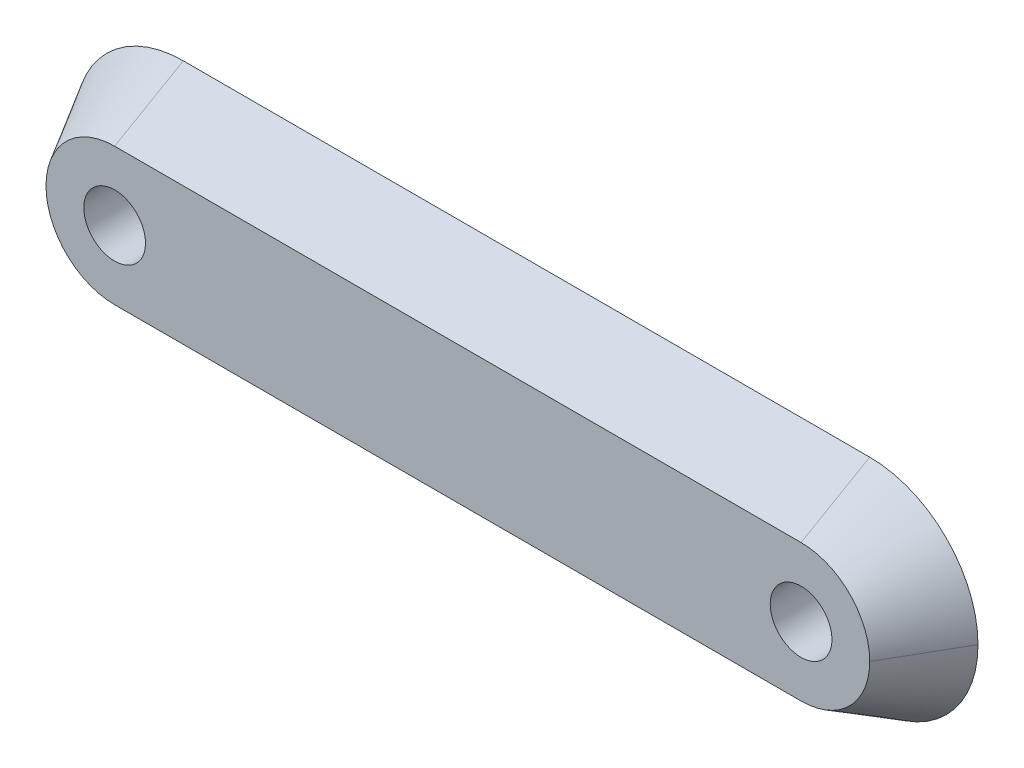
ISO-10303-21;
HEADER;
FILE_DESCRIPTION(('STEP AP214'),'2;1');
FILE_NAME('part.step','',(''),(''),'','','');
FILE_SCHEMA(('AUTOMOTIVE_DESIGN { 1 0 10303 214 1 1 1 1 }'));
ENDSEC;
DATA;
#1=APPLICATION_CONTEXT('core data for automotive mechanical design processes');
#2=APPLICATION_PROTOCOL_DEFINITION('international standard','automotive_design',2000,#1);
#3=PRODUCT_CONTEXT('',#1,'mechanical');
#4=PRODUCT('Part','Part','',(#3));
#5=PRODUCT_RELATED_PRODUCT_CATEGORY('part','',(#4));
#6=PRODUCT_DEFINITION_FORMATION('','',#4);
#7=PRODUCT_DEFINITION_CONTEXT('part definition',#1,'design');
#8=PRODUCT_DEFINITION('design','',#6,#7);
#9=PRODUCT_DEFINITION_SHAPE('','',#8);
#10=(LENGTH_UNIT() NAMED_UNIT(*) SI_UNIT(.MILLI.,.METRE.));
#11=(NAMED_UNIT(*) PLANE_ANGLE_UNIT() SI_UNIT($,.RADIAN.));
#12=(NAMED_UNIT(*) SI_UNIT($,.STERADIAN.) SOLID_ANGLE_UNIT());
#13=UNCERTAINTY_MEASURE_WITH_UNIT(LENGTH_MEASURE(1.E-05),#10,'distance_accuracy_value','');
#14=(GEOMETRIC_REPRESENTATION_CONTEXT(3) GLOBAL_UNCERTAINTY_ASSIGNED_CONTEXT((#13)) GLOBAL_UNIT_ASSIGNED_CONTEXT((#10,
#11,#12)) REPRESENTATION_CONTEXT('',''));
#15=CARTESIAN_POINT('',(0.,0.,0.));
#16=DIRECTION('',(0.,0.,1.));
#17=DIRECTION('',(1.,0.,0.));
#18=AXIS2_PLACEMENT_3D('',#15,#16,#17);
#19=CARTESIAN_POINT('',(30.,-5.,5.));
#20=DIRECTION('',(0.,-0.866025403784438,0.500000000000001));
#21=DIRECTION('',(0.,-0.500000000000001,-0.866025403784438));
#22=AXIS2_PLACEMENT_3D('',#19,#20,#21);
#23=PLANE('',#22);
#24=DIRECTION('',(-1.,0.,0.));
#25=VECTOR('',#24,1.);
#26=CARTESIAN_POINT('',(30.,-7.88675134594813,0.));
#27=LINE('',#26,#25);
#28=CARTESIAN_POINT('',(-25.,-7.88675134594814,0.));
#29=VERTEX_POINT('',#28);
#30=CARTESIAN_POINT('',(25.,-7.88675134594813,0.));
#31=VERTEX_POINT('',#30);
#32=EDGE_CURVE('E102',#29,#31,#27,.F.);
#33=ORIENTED_EDGE('',*,*,#32,.T.);
#34=DIRECTION('',(0.,-0.500000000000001,-0.866025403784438));
#35=VECTOR('',#34,1.);
#36=CARTESIAN_POINT('',(25.,-5.,5.));
#37=LINE('',#36,#35);
#38=CARTESIAN_POINT('',(25.,-5.,5.));
#39=VERTEX_POINT('',#38);
#40=EDGE_CURVE('E11',#31,#39,#37,.F.);
#41=ORIENTED_EDGE('',*,*,#40,.T.);
#42=DIRECTION('',(1.,0.,0.));
#43=VECTOR('',#42,1.);
#44=CARTESIAN_POINT('',(30.,-5.,5.));
#45=LINE('',#44,#43);
#46=CARTESIAN_POINT('',(-25.,-5.,5.));
#47=VERTEX_POINT('',#46);
#48=EDGE_CURVE('E101',#47,#39,#45,.T.);
#49=ORIENTED_EDGE('',*,*,#48,.F.);
#50=DIRECTION('',(0.,-0.500000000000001,-0.866025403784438));
#51=VECTOR('',#50,1.);
#52=CARTESIAN_POINT('',(-25.,-5.,5.));
#53=LINE('',#52,#51);
#54=EDGE_CURVE('E42',#47,#29,#53,.T.);
#55=ORIENTED_EDGE('',*,*,#54,.T.);
#56=EDGE_LOOP('',(#33,#41,#49,#55));
#57=FACE_BOUND('',#56,.T.);
#58=ADVANCED_FACE('F32',(#57),#23,.T.);
#59=CARTESIAN_POINT('',(30.,5.,5.));
#60=DIRECTION('',(0.,0.866025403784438,0.500000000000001));
#61=DIRECTION('',(0.,-0.500000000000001,0.866025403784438));
#62=AXIS2_PLACEMENT_3D('',#59,#60,#61);
#63=PLANE('',#62);
#64=DIRECTION('',(-1.,0.,0.));
#65=VECTOR('',#64,1.);
#66=CARTESIAN_POINT('',(30.,5.,5.));
#67=LINE('',#66,#65);
#68=CARTESIAN_POINT('',(25.,5.,5.));
#69=VERTEX_POINT('',#68);
#70=CARTESIAN_POINT('',(-25.,5.,5.));
#71=VERTEX_POINT('',#70);
#72=EDGE_CURVE('E98',#69,#71,#67,.T.);
#73=ORIENTED_EDGE('',*,*,#72,.F.);
#74=DIRECTION('',(0.,0.500000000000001,-0.866025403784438));
#75=VECTOR('',#74,1.);
#76=CARTESIAN_POINT('',(25.,5.,5.));
#77=LINE('',#76,#75);
#78=CARTESIAN_POINT('',(25.,7.88675134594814,0.));
#79=VERTEX_POINT('',#78);
#80=EDGE_CURVE('E86',#69,#79,#77,.T.);
#81=ORIENTED_EDGE('',*,*,#80,.T.);
#82=DIRECTION('',(1.,0.,0.));
#83=VECTOR('',#82,1.);
#84=CARTESIAN_POINT('',(30.,7.88675134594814,0.));
#85=LINE('',#84,#83);
#86=CARTESIAN_POINT('',(-25.,7.88675134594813,0.));
#87=VERTEX_POINT('',#86);
#88=EDGE_CURVE('E95',#79,#87,#85,.F.);
#89=ORIENTED_EDGE('',*,*,#88,.T.);
#90=DIRECTION('',(0.,0.500000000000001,-0.866025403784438));
#91=VECTOR('',#90,1.);
#92=CARTESIAN_POINT('',(-25.,5.,5.));
#93=LINE('',#92,#91);
#94=EDGE_CURVE('E36',#87,#71,#93,.F.);
#95=ORIENTED_EDGE('',*,*,#94,.T.);
#96=EDGE_LOOP('',(#73,#81,#89,#95));
#97=FACE_BOUND('',#96,.T.);
#98=ADVANCED_FACE('F34',(#97),#63,.T.);
#99=CARTESIAN_POINT('',(0.,0.,5.));
#100=DIRECTION('',(0.,0.,1.));
#101=DIRECTION('',(1.,0.,0.));
#102=AXIS2_PLACEMENT_3D('',#99,#100,#101);
#103=PLANE('',#102);
#104=CARTESIAN_POINT('',(-25.,0.,5.));
#105=DIRECTION('',(0.,0.,-1.));
#106=DIRECTION('',(-1.,0.,0.));
#107=AXIS2_PLACEMENT_3D('',#104,#105,#106);
#108=CIRCLE('',#107,2.2479);
#109=CARTESIAN_POINT('',(-27.2479,0.,5.));
#110=VERTEX_POINT('',#109);
#111=EDGE_CURVE('E136',#110,#110,#108,.T.);
#112=ORIENTED_EDGE('',*,*,#111,.T.);
#113=EDGE_LOOP('',(#112));
#114=FACE_BOUND('',#113,.T.);
#115=CARTESIAN_POINT('',(25.,0.,5.));
#116=DIRECTION('',(0.,0.,-1.));
#117=DIRECTION('',(-1.,0.,0.));
#118=AXIS2_PLACEMENT_3D('',#115,#116,#117);
#119=CIRCLE('',#118,2.2479);
#120=CARTESIAN_POINT('',(22.7521,0.,5.));
#121=VERTEX_POINT('',#120);
#122=EDGE_CURVE('E115',#121,#121,#119,.T.);
#123=ORIENTED_EDGE('',*,*,#122,.T.);
#124=EDGE_LOOP('',(#123));
#125=FACE_BOUND('',#124,.T.);
#126=CARTESIAN_POINT('',(25.,0.,5.));
#127=DIRECTION('',(0.,0.,1.));
#128=DIRECTION('',(1.,0.,0.));
#129=AXIS2_PLACEMENT_3D('',#126,#127,#128);
#130=CIRCLE('',#129,5.);
#131=CARTESIAN_POINT('',(30.,0.,5.));
#132=VERTEX_POINT('',#131);
#133=EDGE_CURVE('E50',#39,#132,#130,.T.);
#134=ORIENTED_EDGE('',*,*,#133,.T.);
#135=CARTESIAN_POINT('',(25.,0.,5.));
#136=DIRECTION('',(0.,0.,1.));
#137=DIRECTION('',(1.,0.,0.));
#138=AXIS2_PLACEMENT_3D('',#135,#136,#137);
#139=CIRCLE('',#138,5.);
#140=EDGE_CURVE('E117',#132,#69,#139,.T.);
#141=ORIENTED_EDGE('',*,*,#140,.T.);
#142=ORIENTED_EDGE('',*,*,#72,.T.);
#143=CARTESIAN_POINT('',(-25.,0.,5.));
#144=DIRECTION('',(0.,0.,1.));
#145=DIRECTION('',(1.,0.,0.));
#146=AXIS2_PLACEMENT_3D('',#143,#144,#145);
#147=CIRCLE('',#146,5.);
#148=CARTESIAN_POINT('',(-30.,0.,5.));
#149=VERTEX_POINT('',#148);
#150=EDGE_CURVE('E89',#71,#149,#147,.T.);
#151=ORIENTED_EDGE('',*,*,#150,.T.);
#152=CARTESIAN_POINT('',(-25.,0.,5.));
#153=DIRECTION('',(0.,0.,1.));
#154=DIRECTION('',(1.,0.,0.));
#155=AXIS2_PLACEMENT_3D('',#152,#153,#154);
#156=CIRCLE('',#155,5.);
#157=EDGE_CURVE('E122',#149,#47,#156,.T.);
#158=ORIENTED_EDGE('',*,*,#157,.T.);
#159=ORIENTED_EDGE('',*,*,#48,.T.);
#160=EDGE_LOOP('',(#134,#141,#142,#151,#158,#159));
#161=FACE_BOUND('',#160,.T.);
#162=ADVANCED_FACE('F151',(#114,#125,#161),#103,.T.);
#163=CARTESIAN_POINT('',(0.,0.,0.));
#164=DIRECTION('',(0.,0.,1.));
#165=DIRECTION('',(1.,0.,0.));
#166=AXIS2_PLACEMENT_3D('',#163,#164,#165);
#167=PLANE('',#166);
#168=CARTESIAN_POINT('',(-25.,0.,0.));
#169=DIRECTION('',(0.,0.,-1.));
#170=DIRECTION('',(-1.,0.,0.));
#171=AXIS2_PLACEMENT_3D('',#168,#169,#170);
#172=CIRCLE('',#171,4.2164);
#173=CARTESIAN_POINT('',(-29.2164,0.,0.));
#174=VERTEX_POINT('',#173);
#175=EDGE_CURVE('E142',#174,#174,#172,.T.);
#176=ORIENTED_EDGE('',*,*,#175,.F.);
#177=EDGE_LOOP('',(#176));
#178=FACE_BOUND('',#177,.T.);
#179=CARTESIAN_POINT('',(25.,0.,0.));
#180=DIRECTION('',(0.,0.,-1.));
#181=DIRECTION('',(-1.,0.,0.));
#182=AXIS2_PLACEMENT_3D('',#179,#180,#181);
#183=CIRCLE('',#182,4.2164);
#184=CARTESIAN_POINT('',(20.7836,0.,0.));
#185=VERTEX_POINT('',#184);
#186=EDGE_CURVE('E133',#185,#185,#183,.T.);
#187=ORIENTED_EDGE('',*,*,#186,.F.);
#188=EDGE_LOOP('',(#187));
#189=FACE_BOUND('',#188,.T.);
#190=ORIENTED_EDGE('',*,*,#88,.F.);
#191=CARTESIAN_POINT('',(25.,0.,0.));
#192=DIRECTION('',(0.,0.,1.));
#193=DIRECTION('',(1.,0.,0.));
#194=AXIS2_PLACEMENT_3D('',#191,#192,#193);
#195=CIRCLE('',#194,7.88675134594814);
#196=CARTESIAN_POINT('',(32.8867513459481,0.,0.));
#197=VERTEX_POINT('',#196);
#198=EDGE_CURVE('E82',#79,#197,#195,.F.);
#199=ORIENTED_EDGE('',*,*,#198,.T.);
#200=CARTESIAN_POINT('',(25.,0.,0.));
#201=DIRECTION('',(0.,0.,1.));
#202=DIRECTION('',(1.,0.,0.));
#203=AXIS2_PLACEMENT_3D('',#200,#201,#202);
#204=CIRCLE('',#203,7.88675134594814);
#205=EDGE_CURVE('E90',#197,#31,#204,.F.);
#206=ORIENTED_EDGE('',*,*,#205,.T.);
#207=ORIENTED_EDGE('',*,*,#32,.F.);
#208=CARTESIAN_POINT('',(-25.,0.,0.));
#209=DIRECTION('',(0.,0.,1.));
#210=DIRECTION('',(1.,0.,0.));
#211=AXIS2_PLACEMENT_3D('',#208,#209,#210);
#212=CIRCLE('',#211,7.88675134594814);
#213=CARTESIAN_POINT('',(-32.8867513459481,0.,0.));
#214=VERTEX_POINT('',#213);
#215=EDGE_CURVE('E109',#29,#214,#212,.F.);
#216=ORIENTED_EDGE('',*,*,#215,.T.);
#217=CARTESIAN_POINT('',(-25.,0.,0.));
#218=DIRECTION('',(0.,0.,1.));
#219=DIRECTION('',(1.,0.,0.));
#220=AXIS2_PLACEMENT_3D('',#217,#218,#219);
#221=CIRCLE('',#220,7.88675134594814);
#222=EDGE_CURVE('E75',#214,#87,#221,.F.);
#223=ORIENTED_EDGE('',*,*,#222,.T.);
#224=EDGE_LOOP('',(#190,#199,#206,#207,#216,#223));
#225=FACE_BOUND('',#224,.T.);
#226=ADVANCED_FACE('F100',(#178,#189,#225),#167,.F.);
#227=CARTESIAN_POINT('',(25.,0.,5.));
#228=DIRECTION('',(0.,0.,-1.));
#229=DIRECTION('',(1.,0.,0.));
#230=AXIS2_PLACEMENT_3D('',#227,#228,#229);
#231=CONICAL_SURFACE('',#230,5.,0.5235987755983);
#232=DIRECTION('',(0.500000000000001,0.,-0.866025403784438));
#233=VECTOR('',#232,1.);
#234=CARTESIAN_POINT('',(30.,0.,5.));
#235=LINE('',#234,#233);
#236=EDGE_CURVE('E87',#132,#197,#235,.T.);
#237=ORIENTED_EDGE('',*,*,#236,.F.);
#238=ORIENTED_EDGE('',*,*,#133,.F.);
#239=ORIENTED_EDGE('',*,*,#40,.F.);
#240=ORIENTED_EDGE('',*,*,#205,.F.);
#241=EDGE_LOOP('',(#237,#238,#239,#240));
#242=FACE_BOUND('',#241,.T.);
#243=ADVANCED_FACE('F150',(#242),#231,.T.);
#244=CARTESIAN_POINT('',(25.,0.,5.));
#245=DIRECTION('',(0.,0.,-1.));
#246=DIRECTION('',(1.,0.,0.));
#247=AXIS2_PLACEMENT_3D('',#244,#245,#246);
#248=CONICAL_SURFACE('',#247,5.,0.5235987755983);
#249=ORIENTED_EDGE('',*,*,#140,.F.);
#250=ORIENTED_EDGE('',*,*,#236,.T.);
#251=ORIENTED_EDGE('',*,*,#198,.F.);
#252=ORIENTED_EDGE('',*,*,#80,.F.);
#253=EDGE_LOOP('',(#249,#250,#251,#252));
#254=FACE_BOUND('',#253,.T.);
#255=ADVANCED_FACE('F85',(#254),#248,.T.);
#256=CARTESIAN_POINT('',(-25.,0.,5.));
#257=DIRECTION('',(0.,0.,-1.));
#258=DIRECTION('',(1.,0.,0.));
#259=AXIS2_PLACEMENT_3D('',#256,#257,#258);
#260=CONICAL_SURFACE('',#259,5.,0.5235987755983);
#261=DIRECTION('',(-0.500000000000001,0.,-0.866025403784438));
#262=VECTOR('',#261,1.);
#263=CARTESIAN_POINT('',(-30.,0.,5.));
#264=LINE('',#263,#262);
#265=EDGE_CURVE('E112',#149,#214,#264,.T.);
#266=ORIENTED_EDGE('',*,*,#265,.F.);
#267=ORIENTED_EDGE('',*,*,#150,.F.);
#268=ORIENTED_EDGE('',*,*,#94,.F.);
#269=ORIENTED_EDGE('',*,*,#222,.F.);
#270=EDGE_LOOP('',(#266,#267,#268,#269));
#271=FACE_BOUND('',#270,.T.);
#272=ADVANCED_FACE('F179',(#271),#260,.T.);
#273=CARTESIAN_POINT('',(-25.,0.,5.));
#274=DIRECTION('',(0.,0.,-1.));
#275=DIRECTION('',(1.,0.,0.));
#276=AXIS2_PLACEMENT_3D('',#273,#274,#275);
#277=CONICAL_SURFACE('',#276,5.,0.5235987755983);
#278=ORIENTED_EDGE('',*,*,#157,.F.);
#279=ORIENTED_EDGE('',*,*,#265,.T.);
#280=ORIENTED_EDGE('',*,*,#215,.F.);
#281=ORIENTED_EDGE('',*,*,#54,.F.);
#282=EDGE_LOOP('',(#278,#279,#280,#281));
#283=FACE_BOUND('',#282,.T.);
#284=ADVANCED_FACE('F167',(#283),#277,.T.);
#285=CARTESIAN_POINT('',(25.,0.,0.));
#286=DIRECTION('',(0.,0.,-1.));
#287=DIRECTION('',(-1.,0.,0.));
#288=AXIS2_PLACEMENT_3D('',#285,#286,#287);
#289=CYLINDRICAL_SURFACE('',#288,2.2479);
#290=ORIENTED_EDGE('',*,*,#122,.F.);
#291=EDGE_LOOP('',(#290));
#292=FACE_BOUND('',#291,.T.);
#293=CARTESIAN_POINT('',(25.,0.,1.65176762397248));
#294=DIRECTION('',(0.,0.,-1.));
#295=DIRECTION('',(-1.,0.,0.));
#296=AXIS2_PLACEMENT_3D('',#293,#294,#295);
#297=CIRCLE('',#296,2.2479);
#298=CARTESIAN_POINT('',(22.7521,0.,1.65176762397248));
#299=VERTEX_POINT('',#298);
#300=EDGE_CURVE('E130',#299,#299,#297,.T.);
#301=ORIENTED_EDGE('',*,*,#300,.T.);
#302=EDGE_LOOP('',(#301));
#303=FACE_BOUND('',#302,.T.);
#304=ADVANCED_FACE('F158',(#292,#303),#289,.F.);
#305=CARTESIAN_POINT('',(25.,0.,0.));
#306=DIRECTION('',(0.,0.,-1.));
#307=DIRECTION('',(-1.,0.,0.));
#308=AXIS2_PLACEMENT_3D('',#305,#306,#307);
#309=CONICAL_SURFACE('',#308,4.2164,0.872664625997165);
#310=ORIENTED_EDGE('',*,*,#300,.F.);
#311=EDGE_LOOP('',(#310));
#312=FACE_BOUND('',#311,.T.);
#313=ORIENTED_EDGE('',*,*,#186,.T.);
#314=EDGE_LOOP('',(#313));
#315=FACE_BOUND('',#314,.T.);
#316=ADVANCED_FACE('F155',(#312,#315),#309,.F.);
#317=CARTESIAN_POINT('',(-25.,0.,0.));
#318=DIRECTION('',(0.,0.,-1.));
#319=DIRECTION('',(-1.,0.,0.));
#320=AXIS2_PLACEMENT_3D('',#317,#318,#319);
#321=CYLINDRICAL_SURFACE('',#320,2.2479);
#322=ORIENTED_EDGE('',*,*,#111,.F.);
#323=EDGE_LOOP('',(#322));
#324=FACE_BOUND('',#323,.T.);
#325=CARTESIAN_POINT('',(-25.,0.,1.65176762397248));
#326=DIRECTION('',(0.,0.,-1.));
#327=DIRECTION('',(-1.,0.,0.));
#328=AXIS2_PLACEMENT_3D('',#325,#326,#327);
#329=CIRCLE('',#328,2.2479);
#330=CARTESIAN_POINT('',(-27.2479,0.,1.65176762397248));
#331=VERTEX_POINT('',#330);
#332=EDGE_CURVE('E139',#331,#331,#329,.T.);
#333=ORIENTED_EDGE('',*,*,#332,.T.);
#334=EDGE_LOOP('',(#333));
#335=FACE_BOUND('',#334,.T.);
#336=ADVANCED_FACE('F157',(#324,#335),#321,.F.);
#337=CARTESIAN_POINT('',(-25.,0.,0.));
#338=DIRECTION('',(0.,0.,-1.));
#339=DIRECTION('',(-1.,0.,0.));
#340=AXIS2_PLACEMENT_3D('',#337,#338,#339);
#341=CONICAL_SURFACE('',#340,4.2164,0.872664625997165);
#342=ORIENTED_EDGE('',*,*,#332,.F.);
#343=EDGE_LOOP('',(#342));
#344=FACE_BOUND('',#343,.T.);
#345=ORIENTED_EDGE('',*,*,#175,.T.);
#346=EDGE_LOOP('',(#345));
#347=FACE_BOUND('',#346,.T.);
#348=ADVANCED_FACE('F146',(#344,#347),#341,.F.);
#349=CLOSED_SHELL('',(#58,#98,#162,#226,#243,#255,#272,#284,#304,#316,#336,#348));
#350=MANIFOLD_SOLID_BREP('B2',#349);
#351=ADVANCED_BREP_SHAPE_REPRESENTATION('',(#18,#350),#14);
#352=SHAPE_DEFINITION_REPRESENTATION(#9,#351);
ENDSEC;
END-ISO-10303-21;
